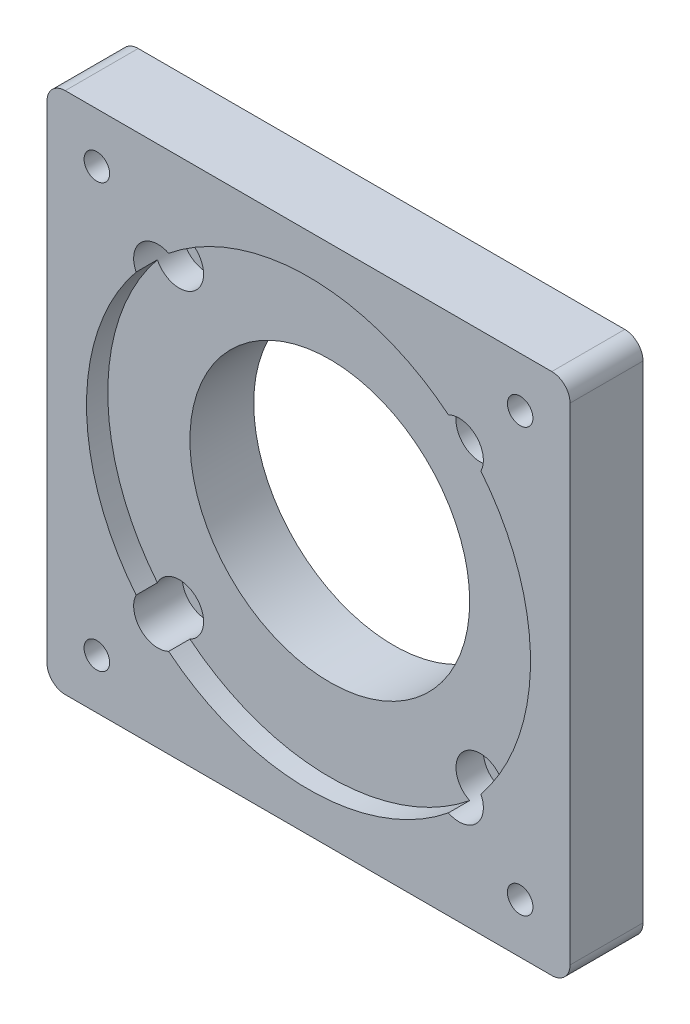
from build123d import *

# Parameters (mm, degrees)
EXTRUDE_1_DEPTH           = 12
SKETCH_2_R                = 23
CUT_EXTRUDE_1_DEPTH       = 62.983868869
SKETCH_3_R                = 36.5
CUT_EXTRUDE_2_DEPTH       = 3.5
HOLE_WIZARD_1_D           = 4.5
HOLE_WIZARD_1_CBORE_D     = 8
HOLE_WIZARD_1_CBORE_DEPTH = 8
HOLE_WIZARD_M5_1_D        = 4.2
HOLE_WIZARD_M5_1_DEPTH    = 12.4
HOLE_WIZARD_M5_1_TIP      = 1.2618073
SKETCH_8_R                = 25
SKETCH_8_R_2              = 23
EXTRUDE_2_DEPTH           = 2


with BuildPart() as part:
    # Sketch 1 → Extrude 1 (new body)
    with BuildSketch(Plane.XY):
        with BuildLine():
            Line((-40, 43), (40, 43))
            ThreePointArc((40, 43), (42.121320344, 42.121320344), (43, 40))
            Line((43, 40), (43, -40))
            ThreePointArc((43, -40), (42.121320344, -42.121320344), (40, -43))
            Line((40, -43), (-40, -43))
            ThreePointArc((-40, -43), (-42.121320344, -42.121320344), (-43, -40))
            Line((-43, -40), (-43, 40))
            ThreePointArc((-43, 40), (-42.121320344, 42.121320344), (-40, 43))
        make_face()
    extrude(amount=EXTRUDE_1_DEPTH)

    # Sketch 2 → Cut-Extrude 1 (cut, through all)
    with BuildSketch(Plane.XY.offset(12)):
        Circle(SKETCH_2_R)
    extrude(amount=-CUT_EXTRUDE_1_DEPTH, mode=Mode.SUBTRACT)

    # Sketch 3 → Cut-Extrude 2 (cut)
    with BuildSketch(Plane.XY.offset(12)):
        Circle(SKETCH_3_R)
    extrude(amount=-CUT_EXTRUDE_2_DEPTH, mode=Mode.SUBTRACT)

    # Hole Wizard 1 (through all)
    with Locations(Plane.XY.offset(12)):
        with Locations((24.748737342, 24.748737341), (-24.748737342, 24.748737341), (-24.748737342, -24.748737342), (24.748737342, -24.748737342)):
            CounterBoreHole(HOLE_WIZARD_1_D / 2, HOLE_WIZARD_1_CBORE_D / 2, HOLE_WIZARD_1_CBORE_DEPTH)

    # Hole Wizard M5 _1
    with Locations(Plane.XY.offset(12)):
        with Locations((-34.8, 34.8), (34.8, 34.8), (-34.8, -34.8), (34.8, -34.8)):
            Hole(HOLE_WIZARD_M5_1_D / 2, depth=HOLE_WIZARD_M5_1_DEPTH)
            with Locations((0, 0, -(HOLE_WIZARD_M5_1_DEPTH + HOLE_WIZARD_M5_1_TIP / 2))):  # 118° drill point
                Cone(0, HOLE_WIZARD_M5_1_D / 2, HOLE_WIZARD_M5_1_TIP, mode=Mode.SUBTRACT)

    # Sketch 8 → Extrude 2 (add)
    with BuildSketch(Plane(origin=(0, 0, 0), x_dir=(-1, 0, 0), z_dir=(0, 0, -1))):
        with Locations(Location((0, 0, 0), (0, 0, 180))):
            Circle(SKETCH_8_R)
        with Locations(Location((0, 0, 0), (0, 0, 180))):
            Circle(SKETCH_8_R_2, mode=Mode.SUBTRACT)
    extrude(amount=EXTRUDE_2_DEPTH)


solid = part.part
